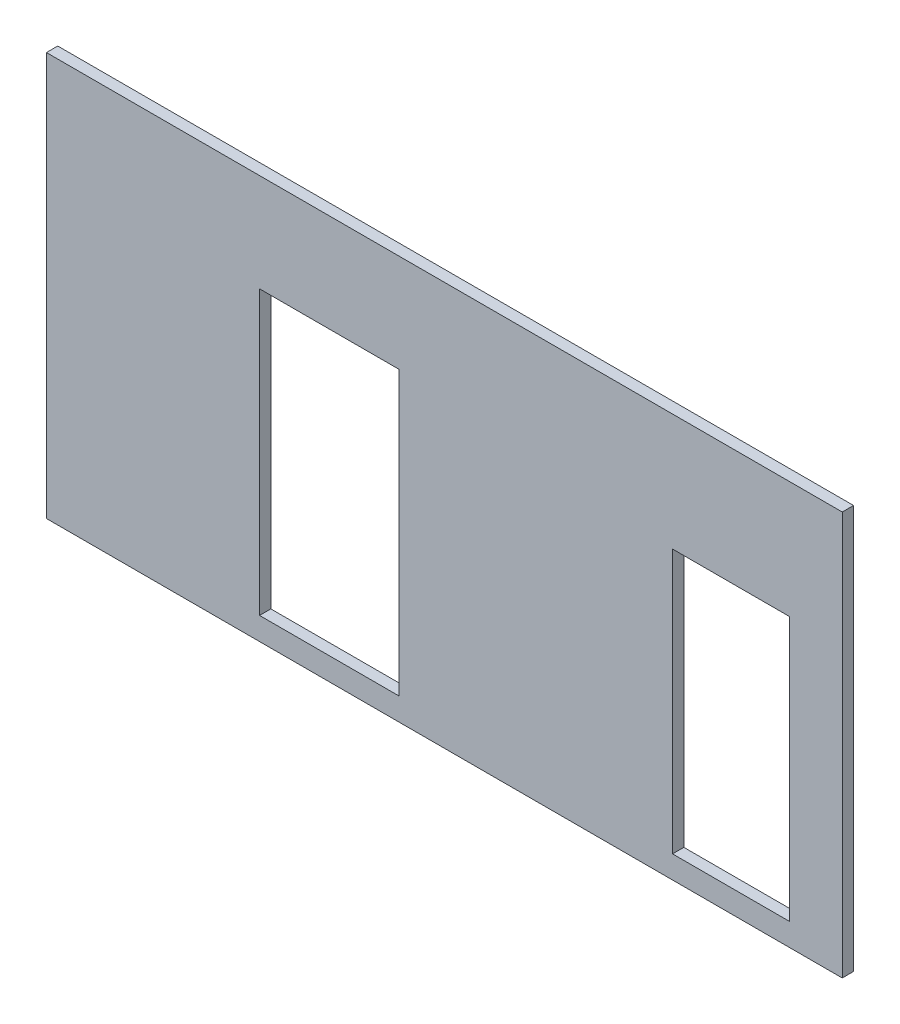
ISO-10303-21;
HEADER;
FILE_DESCRIPTION(('STEP AP214'),'2;1');
FILE_NAME('part.step','',(''),(''),'','','');
FILE_SCHEMA(('AUTOMOTIVE_DESIGN { 1 0 10303 214 1 1 1 1 }'));
ENDSEC;
DATA;
#1=APPLICATION_CONTEXT('core data for automotive mechanical design processes');
#2=APPLICATION_PROTOCOL_DEFINITION('international standard','automotive_design',2000,#1);
#3=PRODUCT_CONTEXT('',#1,'mechanical');
#4=PRODUCT('Part','Part','',(#3));
#5=PRODUCT_RELATED_PRODUCT_CATEGORY('part','',(#4));
#6=PRODUCT_DEFINITION_FORMATION('','',#4);
#7=PRODUCT_DEFINITION_CONTEXT('part definition',#1,'design');
#8=PRODUCT_DEFINITION('design','',#6,#7);
#9=PRODUCT_DEFINITION_SHAPE('','',#8);
#10=(LENGTH_UNIT() NAMED_UNIT(*) SI_UNIT(.MILLI.,.METRE.));
#11=(NAMED_UNIT(*) PLANE_ANGLE_UNIT() SI_UNIT($,.RADIAN.));
#12=(NAMED_UNIT(*) SI_UNIT($,.STERADIAN.) SOLID_ANGLE_UNIT());
#13=UNCERTAINTY_MEASURE_WITH_UNIT(LENGTH_MEASURE(1.E-05),#10,'distance_accuracy_value','');
#14=(GEOMETRIC_REPRESENTATION_CONTEXT(3) GLOBAL_UNCERTAINTY_ASSIGNED_CONTEXT((#13)) GLOBAL_UNIT_ASSIGNED_CONTEXT((#10,
#11,#12)) REPRESENTATION_CONTEXT('',''));
#15=CARTESIAN_POINT('',(0.,0.,0.));
#16=DIRECTION('',(0.,0.,1.));
#17=DIRECTION('',(1.,0.,0.));
#18=AXIS2_PLACEMENT_3D('',#15,#16,#17);
#19=CARTESIAN_POINT('',(0.,0.,3.));
#20=DIRECTION('',(1.,0.,0.));
#21=DIRECTION('',(0.,0.,-1.));
#22=AXIS2_PLACEMENT_3D('',#19,#20,#21);
#23=PLANE('',#22);
#24=DIRECTION('',(0.,-1.,0.));
#25=VECTOR('',#24,1.);
#26=CARTESIAN_POINT('',(0.,0.,0.));
#27=LINE('',#26,#25);
#28=CARTESIAN_POINT('',(0.,107.,0.));
#29=VERTEX_POINT('',#28);
#30=CARTESIAN_POINT('',(0.,0.,0.));
#31=VERTEX_POINT('',#30);
#32=EDGE_CURVE('E181',#29,#31,#27,.T.);
#33=ORIENTED_EDGE('',*,*,#32,.T.);
#34=DIRECTION('',(0.,0.,-1.));
#35=VECTOR('',#34,1.);
#36=CARTESIAN_POINT('',(0.,0.,3.));
#37=LINE('',#36,#35);
#38=CARTESIAN_POINT('',(0.,0.,3.));
#39=VERTEX_POINT('',#38);
#40=EDGE_CURVE('E11',#39,#31,#37,.T.);
#41=ORIENTED_EDGE('',*,*,#40,.F.);
#42=DIRECTION('',(0.,-1.,0.));
#43=VECTOR('',#42,1.);
#44=CARTESIAN_POINT('',(0.,0.,3.));
#45=LINE('',#44,#43);
#46=CARTESIAN_POINT('',(0.,107.,3.));
#47=VERTEX_POINT('',#46);
#48=EDGE_CURVE('E188',#47,#39,#45,.T.);
#49=ORIENTED_EDGE('',*,*,#48,.F.);
#50=DIRECTION('',(0.,0.,-1.));
#51=VECTOR('',#50,1.);
#52=CARTESIAN_POINT('',(0.,107.,3.));
#53=LINE('',#52,#51);
#54=EDGE_CURVE('E198',#47,#29,#53,.T.);
#55=ORIENTED_EDGE('',*,*,#54,.T.);
#56=EDGE_LOOP('',(#33,#41,#49,#55));
#57=FACE_BOUND('',#56,.T.);
#58=ADVANCED_FACE('F31',(#57),#23,.F.);
#59=CARTESIAN_POINT('',(0.,0.,3.));
#60=DIRECTION('',(0.,1.,0.));
#61=DIRECTION('',(0.,0.,1.));
#62=AXIS2_PLACEMENT_3D('',#59,#60,#61);
#63=PLANE('',#62);
#64=DIRECTION('',(1.,0.,0.));
#65=VECTOR('',#64,1.);
#66=CARTESIAN_POINT('',(0.,0.,0.));
#67=LINE('',#66,#65);
#68=CARTESIAN_POINT('',(211.,0.,0.));
#69=VERTEX_POINT('',#68);
#70=EDGE_CURVE('E201',#31,#69,#67,.T.);
#71=ORIENTED_EDGE('',*,*,#70,.T.);
#72=DIRECTION('',(0.,0.,-1.));
#73=VECTOR('',#72,1.);
#74=CARTESIAN_POINT('',(211.,0.,3.));
#75=LINE('',#74,#73);
#76=CARTESIAN_POINT('',(211.,0.,3.));
#77=VERTEX_POINT('',#76);
#78=EDGE_CURVE('E38',#77,#69,#75,.T.);
#79=ORIENTED_EDGE('',*,*,#78,.F.);
#80=DIRECTION('',(1.,0.,0.));
#81=VECTOR('',#80,1.);
#82=CARTESIAN_POINT('',(0.,0.,3.));
#83=LINE('',#82,#81);
#84=EDGE_CURVE('E191',#39,#77,#83,.T.);
#85=ORIENTED_EDGE('',*,*,#84,.F.);
#86=ORIENTED_EDGE('',*,*,#40,.T.);
#87=EDGE_LOOP('',(#71,#79,#85,#86));
#88=FACE_BOUND('',#87,.T.);
#89=ADVANCED_FACE('F230',(#88),#63,.F.);
#90=CARTESIAN_POINT('',(211.,0.,3.));
#91=DIRECTION('',(-1.,0.,0.));
#92=DIRECTION('',(0.,0.,1.));
#93=AXIS2_PLACEMENT_3D('',#90,#91,#92);
#94=PLANE('',#93);
#95=DIRECTION('',(0.,1.,0.));
#96=VECTOR('',#95,1.);
#97=CARTESIAN_POINT('',(211.,0.,0.));
#98=LINE('',#97,#96);
#99=CARTESIAN_POINT('',(211.,107.,0.));
#100=VERTEX_POINT('',#99);
#101=EDGE_CURVE('E203',#69,#100,#98,.T.);
#102=ORIENTED_EDGE('',*,*,#101,.T.);
#103=DIRECTION('',(0.,0.,-1.));
#104=VECTOR('',#103,1.);
#105=CARTESIAN_POINT('',(211.,107.,3.));
#106=LINE('',#105,#104);
#107=CARTESIAN_POINT('',(211.,107.,3.));
#108=VERTEX_POINT('',#107);
#109=EDGE_CURVE('E208',#108,#100,#106,.T.);
#110=ORIENTED_EDGE('',*,*,#109,.F.);
#111=DIRECTION('',(0.,1.,0.));
#112=VECTOR('',#111,1.);
#113=CARTESIAN_POINT('',(211.,0.,3.));
#114=LINE('',#113,#112);
#115=EDGE_CURVE('E194',#77,#108,#114,.T.);
#116=ORIENTED_EDGE('',*,*,#115,.F.);
#117=ORIENTED_EDGE('',*,*,#78,.T.);
#118=EDGE_LOOP('',(#102,#110,#116,#117));
#119=FACE_BOUND('',#118,.T.);
#120=ADVANCED_FACE('F215',(#119),#94,.F.);
#121=CARTESIAN_POINT('',(0.,107.,3.));
#122=DIRECTION('',(0.,-1.,0.));
#123=DIRECTION('',(0.,0.,-1.));
#124=AXIS2_PLACEMENT_3D('',#121,#122,#123);
#125=PLANE('',#124);
#126=DIRECTION('',(-1.,0.,0.));
#127=VECTOR('',#126,1.);
#128=CARTESIAN_POINT('',(0.,107.,0.));
#129=LINE('',#128,#127);
#130=EDGE_CURVE('E192',#100,#29,#129,.T.);
#131=ORIENTED_EDGE('',*,*,#130,.T.);
#132=ORIENTED_EDGE('',*,*,#54,.F.);
#133=DIRECTION('',(-1.,0.,0.));
#134=VECTOR('',#133,1.);
#135=CARTESIAN_POINT('',(0.,107.,3.));
#136=LINE('',#135,#134);
#137=EDGE_CURVE('E196',#108,#47,#136,.T.);
#138=ORIENTED_EDGE('',*,*,#137,.F.);
#139=ORIENTED_EDGE('',*,*,#109,.T.);
#140=EDGE_LOOP('',(#131,#132,#138,#139));
#141=FACE_BOUND('',#140,.T.);
#142=ADVANCED_FACE('F223',(#141),#125,.F.);
#143=CARTESIAN_POINT('',(0.,107.,3.));
#144=DIRECTION('',(0.,0.,-1.));
#145=DIRECTION('',(-1.,0.,0.));
#146=AXIS2_PLACEMENT_3D('',#143,#144,#145);
#147=PLANE('',#146);
#148=DIRECTION('',(1.,0.,0.));
#149=VECTOR('',#148,1.);
#150=CARTESIAN_POINT('',(166.,6.,3.));
#151=LINE('',#150,#149);
#152=CARTESIAN_POINT('',(166.,6.00000000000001,3.));
#153=VERTEX_POINT('',#152);
#154=CARTESIAN_POINT('',(197.,6.,3.));
#155=VERTEX_POINT('',#154);
#156=EDGE_CURVE('E146',#153,#155,#151,.T.);
#157=ORIENTED_EDGE('',*,*,#156,.F.);
#158=DIRECTION('',(0.,-1.,0.));
#159=VECTOR('',#158,1.);
#160=CARTESIAN_POINT('',(166.,6.,3.));
#161=LINE('',#160,#159);
#162=CARTESIAN_POINT('',(166.,76.,3.));
#163=VERTEX_POINT('',#162);
#164=EDGE_CURVE('E45',#163,#153,#161,.T.);
#165=ORIENTED_EDGE('',*,*,#164,.F.);
#166=DIRECTION('',(-1.,0.,0.));
#167=VECTOR('',#166,1.);
#168=CARTESIAN_POINT('',(166.,76.,3.));
#169=LINE('',#168,#167);
#170=CARTESIAN_POINT('',(197.,76.,3.));
#171=VERTEX_POINT('',#170);
#172=EDGE_CURVE('E137',#171,#163,#169,.T.);
#173=ORIENTED_EDGE('',*,*,#172,.F.);
#174=DIRECTION('',(0.,1.,0.));
#175=VECTOR('',#174,1.);
#176=CARTESIAN_POINT('',(197.,6.,3.));
#177=LINE('',#176,#175);
#178=EDGE_CURVE('E140',#155,#171,#177,.T.);
#179=ORIENTED_EDGE('',*,*,#178,.F.);
#180=EDGE_LOOP('',(#157,#165,#173,#179));
#181=FACE_BOUND('',#180,.T.);
#182=DIRECTION('',(1.,0.,0.));
#183=VECTOR('',#182,1.);
#184=CARTESIAN_POINT('',(56.5,6.,3.));
#185=LINE('',#184,#183);
#186=CARTESIAN_POINT('',(56.5,6.00000000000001,3.));
#187=VERTEX_POINT('',#186);
#188=CARTESIAN_POINT('',(93.5,6.,3.));
#189=VERTEX_POINT('',#188);
#190=EDGE_CURVE('E171',#187,#189,#185,.T.);
#191=ORIENTED_EDGE('',*,*,#190,.F.);
#192=DIRECTION('',(0.,-1.,0.));
#193=VECTOR('',#192,1.);
#194=CARTESIAN_POINT('',(56.5,6.,3.));
#195=LINE('',#194,#193);
#196=CARTESIAN_POINT('',(56.5,81.,3.));
#197=VERTEX_POINT('',#196);
#198=EDGE_CURVE('E152',#197,#187,#195,.T.);
#199=ORIENTED_EDGE('',*,*,#198,.F.);
#200=DIRECTION('',(-1.,0.,0.));
#201=VECTOR('',#200,1.);
#202=CARTESIAN_POINT('',(56.5,81.,3.));
#203=LINE('',#202,#201);
#204=CARTESIAN_POINT('',(93.5,81.,3.));
#205=VERTEX_POINT('',#204);
#206=EDGE_CURVE('E160',#205,#197,#203,.T.);
#207=ORIENTED_EDGE('',*,*,#206,.F.);
#208=DIRECTION('',(0.,1.,0.));
#209=VECTOR('',#208,1.);
#210=CARTESIAN_POINT('',(93.5,6.,3.));
#211=LINE('',#210,#209);
#212=EDGE_CURVE('E174',#189,#205,#211,.T.);
#213=ORIENTED_EDGE('',*,*,#212,.F.);
#214=EDGE_LOOP('',(#191,#199,#207,#213));
#215=FACE_BOUND('',#214,.T.);
#216=ORIENTED_EDGE('',*,*,#48,.T.);
#217=ORIENTED_EDGE('',*,*,#84,.T.);
#218=ORIENTED_EDGE('',*,*,#115,.T.);
#219=ORIENTED_EDGE('',*,*,#137,.T.);
#220=EDGE_LOOP('',(#216,#217,#218,#219));
#221=FACE_BOUND('',#220,.T.);
#222=ADVANCED_FACE('F229',(#181,#215,#221),#147,.F.);
#223=CARTESIAN_POINT('',(0.,107.,0.));
#224=DIRECTION('',(0.,0.,-1.));
#225=DIRECTION('',(-1.,0.,0.));
#226=AXIS2_PLACEMENT_3D('',#223,#224,#225);
#227=PLANE('',#226);
#228=DIRECTION('',(0.,-1.,0.));
#229=VECTOR('',#228,1.);
#230=CARTESIAN_POINT('',(166.,6.,0.));
#231=LINE('',#230,#229);
#232=CARTESIAN_POINT('',(166.,76.,0.));
#233=VERTEX_POINT('',#232);
#234=CARTESIAN_POINT('',(166.,6.,0.));
#235=VERTEX_POINT('',#234);
#236=EDGE_CURVE('E121',#233,#235,#231,.T.);
#237=ORIENTED_EDGE('',*,*,#236,.T.);
#238=DIRECTION('',(1.,0.,0.));
#239=VECTOR('',#238,1.);
#240=CARTESIAN_POINT('',(166.,6.,0.));
#241=LINE('',#240,#239);
#242=CARTESIAN_POINT('',(197.,6.00000000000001,0.));
#243=VERTEX_POINT('',#242);
#244=EDGE_CURVE('E130',#235,#243,#241,.T.);
#245=ORIENTED_EDGE('',*,*,#244,.T.);
#246=DIRECTION('',(0.,1.,0.));
#247=VECTOR('',#246,1.);
#248=CARTESIAN_POINT('',(197.,6.,0.));
#249=LINE('',#248,#247);
#250=CARTESIAN_POINT('',(197.,76.,0.));
#251=VERTEX_POINT('',#250);
#252=EDGE_CURVE('E53',#243,#251,#249,.T.);
#253=ORIENTED_EDGE('',*,*,#252,.T.);
#254=DIRECTION('',(-1.,0.,0.));
#255=VECTOR('',#254,1.);
#256=CARTESIAN_POINT('',(166.,76.,0.));
#257=LINE('',#256,#255);
#258=EDGE_CURVE('E127',#251,#233,#257,.T.);
#259=ORIENTED_EDGE('',*,*,#258,.T.);
#260=EDGE_LOOP('',(#237,#245,#253,#259));
#261=FACE_BOUND('',#260,.T.);
#262=DIRECTION('',(0.,-1.,0.));
#263=VECTOR('',#262,1.);
#264=CARTESIAN_POINT('',(56.5,6.,0.));
#265=LINE('',#264,#263);
#266=CARTESIAN_POINT('',(56.5,81.,0.));
#267=VERTEX_POINT('',#266);
#268=CARTESIAN_POINT('',(56.5,6.,0.));
#269=VERTEX_POINT('',#268);
#270=EDGE_CURVE('E156',#267,#269,#265,.T.);
#271=ORIENTED_EDGE('',*,*,#270,.T.);
#272=DIRECTION('',(1.,0.,0.));
#273=VECTOR('',#272,1.);
#274=CARTESIAN_POINT('',(56.5,6.,0.));
#275=LINE('',#274,#273);
#276=CARTESIAN_POINT('',(93.5,6.00000000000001,0.));
#277=VERTEX_POINT('',#276);
#278=EDGE_CURVE('E159',#269,#277,#275,.T.);
#279=ORIENTED_EDGE('',*,*,#278,.T.);
#280=DIRECTION('',(0.,1.,0.));
#281=VECTOR('',#280,1.);
#282=CARTESIAN_POINT('',(93.5,6.,0.));
#283=LINE('',#282,#281);
#284=CARTESIAN_POINT('',(93.5,81.,0.));
#285=VERTEX_POINT('',#284);
#286=EDGE_CURVE('E163',#277,#285,#283,.T.);
#287=ORIENTED_EDGE('',*,*,#286,.T.);
#288=DIRECTION('',(-1.,0.,0.));
#289=VECTOR('',#288,1.);
#290=CARTESIAN_POINT('',(56.5,81.,0.));
#291=LINE('',#290,#289);
#292=EDGE_CURVE('E166',#285,#267,#291,.T.);
#293=ORIENTED_EDGE('',*,*,#292,.T.);
#294=EDGE_LOOP('',(#271,#279,#287,#293));
#295=FACE_BOUND('',#294,.T.);
#296=ORIENTED_EDGE('',*,*,#32,.F.);
#297=ORIENTED_EDGE('',*,*,#130,.F.);
#298=ORIENTED_EDGE('',*,*,#101,.F.);
#299=ORIENTED_EDGE('',*,*,#70,.F.);
#300=EDGE_LOOP('',(#296,#297,#298,#299));
#301=FACE_BOUND('',#300,.T.);
#302=ADVANCED_FACE('F134',(#261,#295,#301),#227,.T.);
#303=CARTESIAN_POINT('',(56.5,6.,0.));
#304=DIRECTION('',(-1.,0.,0.));
#305=DIRECTION('',(0.,0.,1.));
#306=AXIS2_PLACEMENT_3D('',#303,#304,#305);
#307=PLANE('',#306);
#308=ORIENTED_EDGE('',*,*,#198,.T.);
#309=DIRECTION('',(0.,0.,1.));
#310=VECTOR('',#309,1.);
#311=CARTESIAN_POINT('',(56.5,6.,0.));
#312=LINE('',#311,#310);
#313=EDGE_CURVE('E169',#269,#187,#312,.T.);
#314=ORIENTED_EDGE('',*,*,#313,.F.);
#315=ORIENTED_EDGE('',*,*,#270,.F.);
#316=DIRECTION('',(0.,0.,1.));
#317=VECTOR('',#316,1.);
#318=CARTESIAN_POINT('',(56.5,81.,0.));
#319=LINE('',#318,#317);
#320=EDGE_CURVE('E179',#267,#197,#319,.T.);
#321=ORIENTED_EDGE('',*,*,#320,.T.);
#322=EDGE_LOOP('',(#308,#314,#315,#321));
#323=FACE_BOUND('',#322,.T.);
#324=ADVANCED_FACE('F242',(#323),#307,.F.);
#325=CARTESIAN_POINT('',(56.5,81.,0.));
#326=DIRECTION('',(0.,1.,0.));
#327=DIRECTION('',(0.,0.,1.));
#328=AXIS2_PLACEMENT_3D('',#325,#326,#327);
#329=PLANE('',#328);
#330=ORIENTED_EDGE('',*,*,#206,.T.);
#331=ORIENTED_EDGE('',*,*,#320,.F.);
#332=ORIENTED_EDGE('',*,*,#292,.F.);
#333=DIRECTION('',(0.,0.,1.));
#334=VECTOR('',#333,1.);
#335=CARTESIAN_POINT('',(93.5,81.,0.));
#336=LINE('',#335,#334);
#337=EDGE_CURVE('E182',#285,#205,#336,.T.);
#338=ORIENTED_EDGE('',*,*,#337,.T.);
#339=EDGE_LOOP('',(#330,#331,#332,#338));
#340=FACE_BOUND('',#339,.T.);
#341=ADVANCED_FACE('F248',(#340),#329,.F.);
#342=CARTESIAN_POINT('',(93.5,6.,0.));
#343=DIRECTION('',(1.,0.,0.));
#344=DIRECTION('',(0.,0.,-1.));
#345=AXIS2_PLACEMENT_3D('',#342,#343,#344);
#346=PLANE('',#345);
#347=ORIENTED_EDGE('',*,*,#212,.T.);
#348=ORIENTED_EDGE('',*,*,#337,.F.);
#349=ORIENTED_EDGE('',*,*,#286,.F.);
#350=DIRECTION('',(0.,0.,1.));
#351=VECTOR('',#350,1.);
#352=CARTESIAN_POINT('',(93.5,6.,0.));
#353=LINE('',#352,#351);
#354=EDGE_CURVE('E184',#277,#189,#353,.T.);
#355=ORIENTED_EDGE('',*,*,#354,.T.);
#356=EDGE_LOOP('',(#347,#348,#349,#355));
#357=FACE_BOUND('',#356,.T.);
#358=ADVANCED_FACE('F253',(#357),#346,.F.);
#359=CARTESIAN_POINT('',(56.5,6.,0.));
#360=DIRECTION('',(0.,-1.,0.));
#361=DIRECTION('',(0.,0.,-1.));
#362=AXIS2_PLACEMENT_3D('',#359,#360,#361);
#363=PLANE('',#362);
#364=ORIENTED_EDGE('',*,*,#190,.T.);
#365=ORIENTED_EDGE('',*,*,#354,.F.);
#366=ORIENTED_EDGE('',*,*,#278,.F.);
#367=ORIENTED_EDGE('',*,*,#313,.T.);
#368=EDGE_LOOP('',(#364,#365,#366,#367));
#369=FACE_BOUND('',#368,.T.);
#370=ADVANCED_FACE('F250',(#369),#363,.F.);
#371=CARTESIAN_POINT('',(166.,6.,0.));
#372=DIRECTION('',(-1.,0.,0.));
#373=DIRECTION('',(0.,0.,1.));
#374=AXIS2_PLACEMENT_3D('',#371,#372,#373);
#375=PLANE('',#374);
#376=ORIENTED_EDGE('',*,*,#164,.T.);
#377=DIRECTION('',(0.,0.,1.));
#378=VECTOR('',#377,1.);
#379=CARTESIAN_POINT('',(166.,6.,0.));
#380=LINE('',#379,#378);
#381=EDGE_CURVE('E117',#235,#153,#380,.T.);
#382=ORIENTED_EDGE('',*,*,#381,.F.);
#383=ORIENTED_EDGE('',*,*,#236,.F.);
#384=DIRECTION('',(0.,0.,1.));
#385=VECTOR('',#384,1.);
#386=CARTESIAN_POINT('',(166.,76.,0.));
#387=LINE('',#386,#385);
#388=EDGE_CURVE('E150',#233,#163,#387,.T.);
#389=ORIENTED_EDGE('',*,*,#388,.T.);
#390=EDGE_LOOP('',(#376,#382,#383,#389));
#391=FACE_BOUND('',#390,.T.);
#392=ADVANCED_FACE('F119',(#391),#375,.F.);
#393=CARTESIAN_POINT('',(166.,76.,0.));
#394=DIRECTION('',(0.,1.,0.));
#395=DIRECTION('',(0.,0.,1.));
#396=AXIS2_PLACEMENT_3D('',#393,#394,#395);
#397=PLANE('',#396);
#398=ORIENTED_EDGE('',*,*,#172,.T.);
#399=ORIENTED_EDGE('',*,*,#388,.F.);
#400=ORIENTED_EDGE('',*,*,#258,.F.);
#401=DIRECTION('',(0.,0.,1.));
#402=VECTOR('',#401,1.);
#403=CARTESIAN_POINT('',(197.,76.,0.));
#404=LINE('',#403,#402);
#405=EDGE_CURVE('E153',#251,#171,#404,.T.);
#406=ORIENTED_EDGE('',*,*,#405,.T.);
#407=EDGE_LOOP('',(#398,#399,#400,#406));
#408=FACE_BOUND('',#407,.T.);
#409=ADVANCED_FACE('F263',(#408),#397,.F.);
#410=CARTESIAN_POINT('',(197.,6.,0.));
#411=DIRECTION('',(1.,0.,0.));
#412=DIRECTION('',(0.,0.,-1.));
#413=AXIS2_PLACEMENT_3D('',#410,#411,#412);
#414=PLANE('',#413);
#415=ORIENTED_EDGE('',*,*,#178,.T.);
#416=ORIENTED_EDGE('',*,*,#405,.F.);
#417=ORIENTED_EDGE('',*,*,#252,.F.);
#418=DIRECTION('',(0.,0.,1.));
#419=VECTOR('',#418,1.);
#420=CARTESIAN_POINT('',(197.,6.,0.));
#421=LINE('',#420,#419);
#422=EDGE_CURVE('E126',#243,#155,#421,.T.);
#423=ORIENTED_EDGE('',*,*,#422,.T.);
#424=EDGE_LOOP('',(#415,#416,#417,#423));
#425=FACE_BOUND('',#424,.T.);
#426=ADVANCED_FACE('F266',(#425),#414,.F.);
#427=CARTESIAN_POINT('',(166.,6.,0.));
#428=DIRECTION('',(0.,-1.,0.));
#429=DIRECTION('',(0.,0.,-1.));
#430=AXIS2_PLACEMENT_3D('',#427,#428,#429);
#431=PLANE('',#430);
#432=ORIENTED_EDGE('',*,*,#156,.T.);
#433=ORIENTED_EDGE('',*,*,#422,.F.);
#434=ORIENTED_EDGE('',*,*,#244,.F.);
#435=ORIENTED_EDGE('',*,*,#381,.T.);
#436=EDGE_LOOP('',(#432,#433,#434,#435));
#437=FACE_BOUND('',#436,.T.);
#438=ADVANCED_FACE('F131',(#437),#431,.F.);
#439=CLOSED_SHELL('',(#58,#89,#120,#142,#222,#302,#324,#341,#358,#370,#392,#409,#426,#438));
#440=MANIFOLD_SOLID_BREP('B2',#439);
#441=ADVANCED_BREP_SHAPE_REPRESENTATION('',(#18,#440),#14);
#442=SHAPE_DEFINITION_REPRESENTATION(#9,#441);
ENDSEC;
END-ISO-10303-21;
